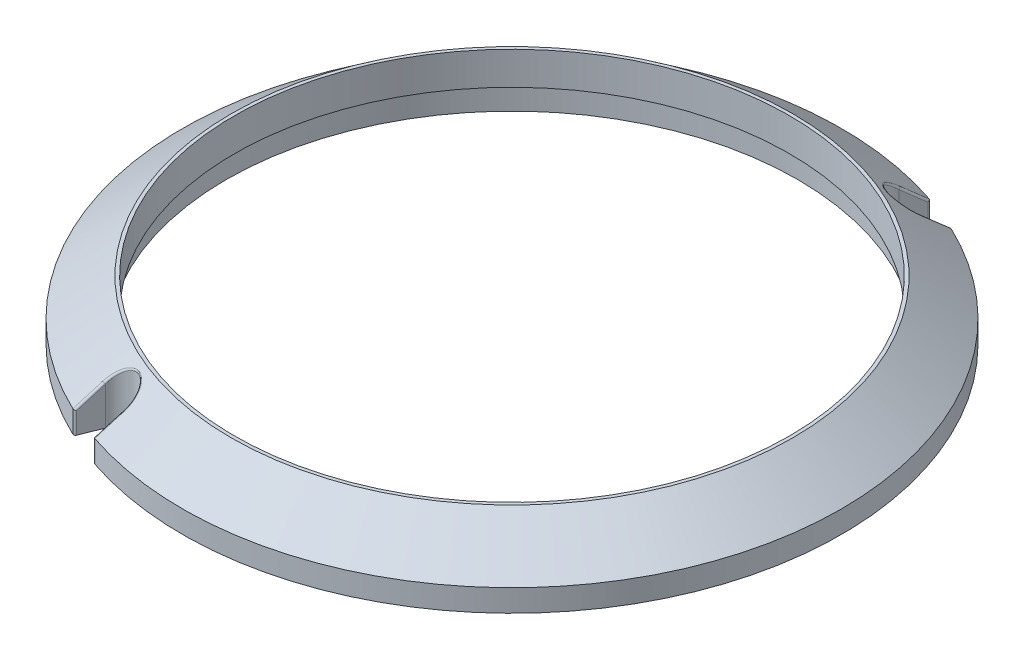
from build123d import *

# Parameters (mm, degrees)
CUT_EXTRUDE5_DEPTH       = 182.054079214
FILLET1_R                = 0.762
CIRPATTERN1_COUNT        = 2
FILLET1_OF_CIRPATTERN1_R = 0.762


with BuildPart() as part:
    # Sketch2 → Revolve2 (revolve)
    with BuildSketch(Plane.XY, mode=Mode.PRIVATE) as revolve2_sk:
        Polygon((-106.9467, 29.21), (-108.2167, 29.21), (-127, 14.894699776), (-127, 6.35), (-110.0455, 6.35), (-110.0455, 16.51), (-106.9467, 16.51), align=None)
    revolve(revolve2_sk.sketch.rotate(Axis((0, 0, 0), (0, 1, 0)), 180), axis=Axis((0, 0, 0), (0, 1, 0)))

    # Sketch3 → Cut-Extrude5 (cut, through all)
    with BuildSketch(Plane(origin=(0, 29.21, 0), x_dir=(1, 0, 0), z_dir=(0, 1, 0))):
        with BuildLine():
            Line((-50.365536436, -106.351871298), (-53.933664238, -115.183297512))
            Line((-53.933664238, -115.183297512), (-41.216410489, -120.321401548))
            Line((-41.216410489, -120.321401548), (-37.648282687, -111.489975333))
            ThreePointArc((-37.648282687, -111.489975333), (-41.437857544, -102.562296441), (-50.365536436, -106.351871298))
        make_face()
    cut_extrude5 = extrude(amount=-CUT_EXTRUDE5_DEPTH, mode=Mode.SUBTRACT)

    # Fillet1
    fillet1_edges = [part.edges().sort_by_distance(p)[0] for p in [
        (-41.437857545, 27.380661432, 102.56229644),
        (-39.397677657, 18.448258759, 115.819879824),
        (-41.146995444, 10.622349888, 120.149593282),
        (-53.864249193, 10.622349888, 115.011489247),
        (-52.114931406, 18.448258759, 110.681775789),
    ]]
    fillet(fillet1_edges, radius=FILLET1_R)

    # CirPattern1: Cut-Extrude5 ×2 about axis
    cirpattern1_axis = Axis((0, 30.353, 0), (0, -1, 0))
    for i in range(1, CIRPATTERN1_COUNT):
        add(cut_extrude5.rotate(cirpattern1_axis, i * 360 / CIRPATTERN1_COUNT), mode=Mode.SUBTRACT)

    # Fillet1 of CirPattern1
    fillet1_of_cirpattern1_edges = [part.edges().sort_by_distance(p)[0] for p in [
        (41.437857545, 27.380661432, -102.56229644),
        (39.397677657, 18.448258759, -115.819879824),
        (41.146995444, 10.622349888, -120.149593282),
        (53.864249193, 10.622349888, -115.011489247),
        (52.114931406, 18.448258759, -110.681775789),
    ]]
    fillet(fillet1_of_cirpattern1_edges, radius=FILLET1_OF_CIRPATTERN1_R)


solid = part.part
